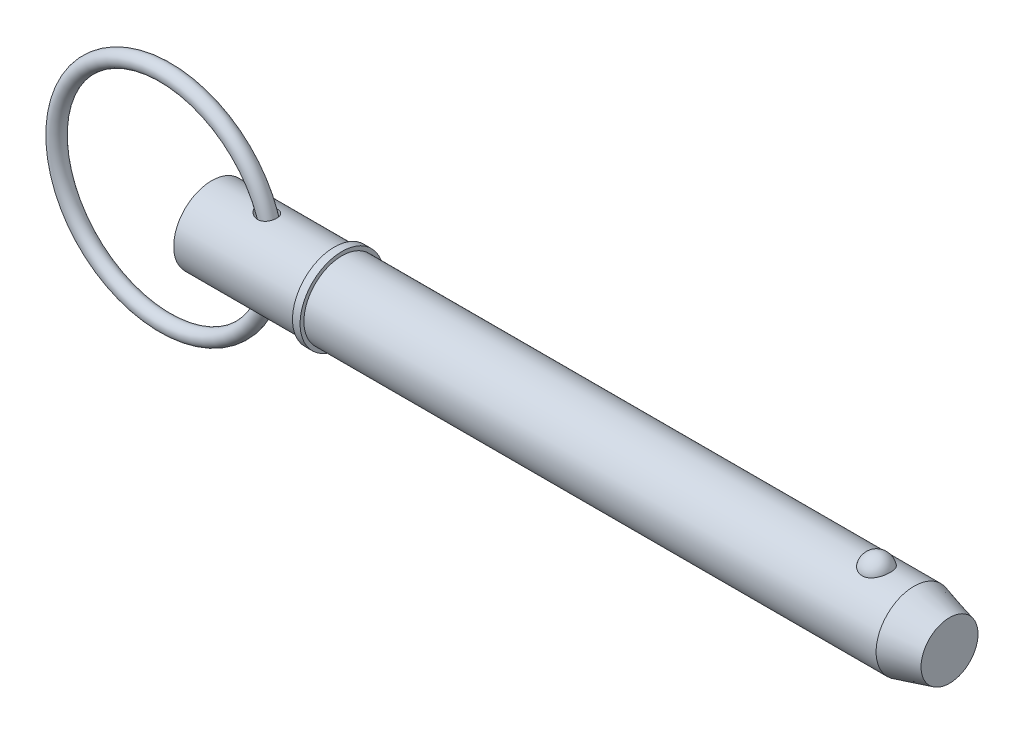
ISO-10303-21;
HEADER;
FILE_DESCRIPTION(('STEP AP214'),'2;1');
FILE_NAME('part.step','',(''),(''),'','','');
FILE_SCHEMA(('AUTOMOTIVE_DESIGN { 1 0 10303 214 1 1 1 1 }'));
ENDSEC;
DATA;
#1=APPLICATION_CONTEXT('core data for automotive mechanical design processes');
#2=APPLICATION_PROTOCOL_DEFINITION('international standard','automotive_design',2000,#1);
#3=PRODUCT_CONTEXT('',#1,'mechanical');
#4=PRODUCT('Part','Part','',(#3));
#5=PRODUCT_RELATED_PRODUCT_CATEGORY('part','',(#4));
#6=PRODUCT_DEFINITION_FORMATION('','',#4);
#7=PRODUCT_DEFINITION_CONTEXT('part definition',#1,'design');
#8=PRODUCT_DEFINITION('design','',#6,#7);
#9=PRODUCT_DEFINITION_SHAPE('','',#8);
#10=(LENGTH_UNIT() NAMED_UNIT(*) SI_UNIT(.MILLI.,.METRE.));
#11=(NAMED_UNIT(*) PLANE_ANGLE_UNIT() SI_UNIT($,.RADIAN.));
#12=(NAMED_UNIT(*) SI_UNIT($,.STERADIAN.) SOLID_ANGLE_UNIT());
#13=UNCERTAINTY_MEASURE_WITH_UNIT(LENGTH_MEASURE(1.E-05),#10,'distance_accuracy_value','');
#14=(GEOMETRIC_REPRESENTATION_CONTEXT(3) GLOBAL_UNCERTAINTY_ASSIGNED_CONTEXT((#13)) GLOBAL_UNIT_ASSIGNED_CONTEXT((#10,
#11,#12)) REPRESENTATION_CONTEXT('',''));
#15=CARTESIAN_POINT('',(0.,0.,0.));
#16=DIRECTION('',(0.,0.,1.));
#17=DIRECTION('',(1.,0.,0.));
#18=AXIS2_PLACEMENT_3D('',#15,#16,#17);
#19=CARTESIAN_POINT('',(-13.640845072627,0.,0.));
#20=DIRECTION('',(0.,0.,1.));
#21=DIRECTION('',(1.,0.,0.));
#22=AXIS2_PLACEMENT_3D('',#19,#20,#21);
#23=TOROIDAL_SURFACE('',#22,31.75,2.223);
#24=CARTESIAN_POINT('',(20.332154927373,0.,0.));
#25=VERTEX_POINT('',#24);
#26=VERTEX_LOOP('',#25);
#27=FACE_BOUND('',#26,.T.);
#28=ADVANCED_FACE('P0_F12',(#27),#23,.T.);
#29=CLOSED_SHELL('',(#28));
#30=MANIFOLD_SOLID_BREP('P0_B1',#29);
#31=CARTESIAN_POINT('',(0.,0.,0.));
#32=DIRECTION('',(1.,0.,0.));
#33=DIRECTION('',(0.,0.,-1.));
#34=AXIS2_PLACEMENT_3D('',#31,#32,#33);
#35=CYLINDRICAL_SURFACE('',#34,11.115);
#36=CARTESIAN_POINT('',(13.5245830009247,11.0328953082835,-1.34849772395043));
#37=CARTESIAN_POINT('',(13.6190616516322,11.0150940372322,-1.49413162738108));
#38=CARTESIAN_POINT('',(13.7272589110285,10.9954577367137,-1.63076546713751));
#39=CARTESIAN_POINT('',(13.9654537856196,10.9550099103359,-1.8834727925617));
#40=CARTESIAN_POINT('',(14.0954990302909,10.9341958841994,-1.99950019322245));
#41=CARTESIAN_POINT('',(14.3718600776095,10.893854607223,-2.20871939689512));
#42=CARTESIAN_POINT('',(14.5180879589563,10.8743212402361,-2.30202655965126));
#43=CARTESIAN_POINT('',(14.8233821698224,10.8385071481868,-2.46515115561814));
#44=CARTESIAN_POINT('',(14.9824448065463,10.8222254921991,-2.53497531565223));
#45=CARTESIAN_POINT('',(15.3233581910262,10.7936101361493,-2.65430007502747));
#46=CARTESIAN_POINT('',(15.5060064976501,10.7817126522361,-2.7016502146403));
#47=CARTESIAN_POINT('',(15.8771124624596,10.7657570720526,-2.76455948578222));
#48=CARTESIAN_POINT('',(16.0655695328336,10.7616981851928,-2.78012182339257));
#49=CARTESIAN_POINT('',(16.4345152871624,10.7624400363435,-2.77724928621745));
#50=CARTESIAN_POINT('',(16.6150121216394,10.7668823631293,-2.76018977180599));
#51=CARTESIAN_POINT('',(16.9695132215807,10.7837407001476,-2.69357457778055));
#52=CARTESIAN_POINT('',(17.1435222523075,10.7961507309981,-2.64404326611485));
#53=CARTESIAN_POINT('',(17.4621418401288,10.8258984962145,-2.51928348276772));
#54=CARTESIAN_POINT('',(17.6079677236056,10.8426430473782,-2.44700611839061));
#55=CARTESIAN_POINT('',(17.884162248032,10.8794194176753,-2.27791740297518));
#56=CARTESIAN_POINT('',(18.0145349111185,10.8994503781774,-2.18111245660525));
#57=CARTESIAN_POINT('',(18.2494965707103,10.9392822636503,-1.9713196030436));
#58=CARTESIAN_POINT('',(18.3550661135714,10.9590421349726,-1.85941863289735));
#59=CARTESIAN_POINT('',(18.5458147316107,10.9970986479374,-1.61919918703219));
#60=CARTESIAN_POINT('',(18.6309947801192,11.0153953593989,-1.49088149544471));
#61=CARTESIAN_POINT('',(18.7786686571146,11.0484675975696,-1.2218388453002));
#62=CARTESIAN_POINT('',(18.8412214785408,11.063252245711,-1.08114735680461));
#63=CARTESIAN_POINT('',(18.9425265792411,11.0877718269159,-0.791025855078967));
#64=CARTESIAN_POINT('',(18.9812780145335,11.0975065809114,-0.641595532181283));
#65=CARTESIAN_POINT('',(19.0343305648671,11.1109435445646,-0.336997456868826));
#66=CARTESIAN_POINT('',(19.0484404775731,11.1145985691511,-0.181794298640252));
#67=CARTESIAN_POINT('',(19.0513147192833,11.1153384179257,0.128864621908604));
#68=CARTESIAN_POINT('',(19.0400783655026,11.112423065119,0.284320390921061));
#69=CARTESIAN_POINT('',(18.9924362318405,11.1003163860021,0.591525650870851));
#70=CARTESIAN_POINT('',(18.9559600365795,11.0911075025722,0.743263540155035));
#71=CARTESIAN_POINT('',(18.858576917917,11.0673920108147,1.0382524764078));
#72=CARTESIAN_POINT('',(18.7976699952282,11.0528854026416,1.18150352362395));
#73=CARTESIAN_POINT('',(18.6529960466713,11.020201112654,1.45511394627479));
#74=CARTESIAN_POINT('',(18.5692772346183,11.0020311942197,1.58549973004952));
#75=CARTESIAN_POINT('',(18.3810003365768,10.9640237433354,1.82995492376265));
#76=CARTESIAN_POINT('',(18.2764441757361,10.9441863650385,1.94402583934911));
#77=CARTESIAN_POINT('',(18.0501398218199,10.9052267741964,2.15183128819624));
#78=CARTESIAN_POINT('',(17.9285270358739,10.8861003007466,2.24571250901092));
#79=CARTESIAN_POINT('',(17.6709592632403,10.8505244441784,2.41175942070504));
#80=CARTESIAN_POINT('',(17.5350055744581,10.8340748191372,2.48392707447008));
#81=CARTESIAN_POINT('',(17.2528390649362,10.8056099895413,2.60497667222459));
#82=CARTESIAN_POINT('',(17.1066353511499,10.7935909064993,2.65387899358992));
#83=CARTESIAN_POINT('',(16.8080326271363,10.7750969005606,2.72799859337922));
#84=CARTESIAN_POINT('',(16.6556326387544,10.7686228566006,2.75321211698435));
#85=CARTESIAN_POINT('',(16.3428877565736,10.761517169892,2.78086153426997));
#86=CARTESIAN_POINT('',(16.1824599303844,10.7611149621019,2.78240297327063));
#87=CARTESIAN_POINT('',(15.863296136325,10.766478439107,2.76156874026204));
#88=CARTESIAN_POINT('',(15.7045607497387,10.7722461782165,2.73918510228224));
#89=CARTESIAN_POINT('',(15.3787211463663,10.7898500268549,2.66904167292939));
#90=CARTESIAN_POINT('',(15.2120794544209,10.8021675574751,2.61925575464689));
#91=CARTESIAN_POINT('',(14.8886284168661,10.8315482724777,2.49496357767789));
#92=CARTESIAN_POINT('',(14.731827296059,10.8486153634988,2.42043695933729));
#93=CARTESIAN_POINT('',(14.4198762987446,10.8870804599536,2.24137362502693));
#94=CARTESIAN_POINT('',(14.2658484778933,10.9087148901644,2.13492229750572));
#95=CARTESIAN_POINT('',(13.9788214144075,10.9526299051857,1.89676517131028));
#96=CARTESIAN_POINT('',(13.8458041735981,10.9749099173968,1.76508120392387));
#97=CARTESIAN_POINT('',(13.6310853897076,11.012885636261,1.50762337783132));
#98=CARTESIAN_POINT('',(13.5444453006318,11.0290026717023,1.38602082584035));
#99=CARTESIAN_POINT('',(13.392158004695,11.0581740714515,1.12983363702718));
#100=CARTESIAN_POINT('',(13.3264946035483,11.0712307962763,0.995259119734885));
#101=CARTESIAN_POINT('',(13.2464179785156,11.0874250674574,0.785640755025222));
#102=CARTESIAN_POINT('',(13.2227369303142,11.0922707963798,0.714166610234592));
#103=CARTESIAN_POINT('',(13.1820656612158,11.1006486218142,0.569277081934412));
#104=CARTESIAN_POINT('',(13.1650721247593,11.1041813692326,0.495862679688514));
#105=CARTESIAN_POINT('',(13.1381118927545,11.1098070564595,0.347711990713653));
#106=CARTESIAN_POINT('',(13.1281436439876,11.1119003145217,0.272975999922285));
#107=CARTESIAN_POINT('',(13.1154243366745,11.1145746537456,0.122890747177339));
#108=CARTESIAN_POINT('',(13.1126723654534,11.1151559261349,0.0475415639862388));
#109=CARTESIAN_POINT('',(13.115160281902,11.1146296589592,-0.160384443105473));
#110=CARTESIAN_POINT('',(13.128061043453,11.111903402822,-0.292944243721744));
#111=CARTESIAN_POINT('',(13.175691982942,11.1019662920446,-0.553751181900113));
#112=CARTESIAN_POINT('',(13.2104121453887,11.094757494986,-0.682000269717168));
#113=CARTESIAN_POINT('',(13.2891255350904,11.0787645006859,-0.901873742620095));
#114=CARTESIAN_POINT('',(13.3290466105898,11.0707438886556,-0.995044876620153));
#115=CARTESIAN_POINT('',(13.4192915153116,11.0529876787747,-1.17599209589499));
#116=CARTESIAN_POINT('',(13.4696154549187,11.0432520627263,-1.26376812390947));
#117=CARTESIAN_POINT('',(13.5245830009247,11.0328953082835,-1.34849772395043));
#118=B_SPLINE_CURVE_WITH_KNOTS('',3,(#36,#37,#38,#39,#40,#41,#42,#43,#44,#45,#46,#47,#48,#49,
#50,#51,#52,#53,#54,#55,#56,#57,#58,#59,#60,#61,#62,#63,#64,#65,#66,#67,#68,#69,#70,#71,#72,#73,
#74,#75,#76,#77,#78,#79,#80,#81,#82,#83,#84,#85,#86,#87,#88,#89,#90,#91,#92,#93,#94,#95,#96,#97,
#98,#99,#100,#101,#102,#103,#104,#105,#106,#107,#108,#109,#110,#111,#112,#113,#114,#115,#116,
#117),.UNSPECIFIED.,.T.,.F.,(4,2,2,2,2,2,2,2,2,2,2,2,2,2,2,2,2,2,2,2,2,2,2,2,2,2,2,2,2,2,2,2,2,
2,2,2,2,2,2,2,4),(0.,0.52309976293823,1.04735506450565,1.56889024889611,2.09027590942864,
2.65465173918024,3.21897064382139,3.76002078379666,4.30066536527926,4.78898318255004,
5.27717362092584,5.74028268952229,6.20336964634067,6.665240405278,7.12712754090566,
7.59258295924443,8.05805091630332,8.52482272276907,8.99159451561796,9.45738731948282,
9.9231371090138,10.3853792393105,10.8475795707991,11.3093743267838,11.7712422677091,
12.2505208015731,12.7299589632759,13.2508366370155,13.7721440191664,14.334890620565,
14.8971525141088,15.3459336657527,15.7943675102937,16.0204422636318,16.2464047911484,
16.4723173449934,16.6982013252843,17.095711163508,17.4930386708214,17.7973741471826,
18.1017128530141),.UNSPECIFIED.);
#119=CARTESIAN_POINT('',(13.5245830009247,11.0328953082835,-1.34849772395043));
#120=VERTEX_POINT('',#119);
#121=EDGE_CURVE('P1_E42',#120,#120,#118,.T.);
#122=ORIENTED_EDGE('',*,*,#121,.T.);
#123=EDGE_LOOP('',(#122));
#124=FACE_BOUND('',#123,.T.);
#125=CARTESIAN_POINT('',(0.,0.,0.));
#126=DIRECTION('',(1.,0.,0.));
#127=DIRECTION('',(0.,0.,-1.));
#128=AXIS2_PLACEMENT_3D('',#125,#126,#127);
#129=CIRCLE('',#128,11.115);
#130=CARTESIAN_POINT('',(0.,0.,-11.115));
#131=VERTEX_POINT('',#130);
#132=EDGE_CURVE('P1_E9',#131,#131,#129,.T.);
#133=ORIENTED_EDGE('',*,*,#132,.T.);
#134=EDGE_LOOP('',(#133));
#135=FACE_BOUND('',#134,.T.);
#136=CARTESIAN_POINT('',(35.877,0.,0.));
#137=DIRECTION('',(1.,0.,0.));
#138=DIRECTION('',(0.,0.,-1.));
#139=AXIS2_PLACEMENT_3D('',#136,#137,#138);
#140=CIRCLE('',#139,11.115);
#141=CARTESIAN_POINT('',(35.877,0.,-11.115));
#142=VERTEX_POINT('',#141);
#143=EDGE_CURVE('P1_E25',#142,#142,#140,.T.);
#144=ORIENTED_EDGE('',*,*,#143,.F.);
#145=EDGE_LOOP('',(#144));
#146=FACE_BOUND('',#145,.T.);
#147=CARTESIAN_POINT('',(13.5245830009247,-11.0328953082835,-1.34849772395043));
#148=CARTESIAN_POINT('',(13.449887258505,-11.0469690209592,-1.233356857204));
#149=CARTESIAN_POINT('',(13.3837464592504,-11.0598986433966,-1.11255897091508));
#150=CARTESIAN_POINT('',(13.271526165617,-11.0822620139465,-0.861680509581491));
#151=CARTESIAN_POINT('',(13.2254273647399,-11.0916991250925,-0.731609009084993));
#152=CARTESIAN_POINT('',(13.1557497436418,-11.1060943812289,-0.464578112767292));
#153=CARTESIAN_POINT('',(13.1322820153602,-11.111030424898,-0.327588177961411));
#154=CARTESIAN_POINT('',(13.1098958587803,-11.1157368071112,-0.0515139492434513));
#155=CARTESIAN_POINT('',(13.1109730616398,-11.1155080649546,0.0875699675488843));
#156=CARTESIAN_POINT('',(13.1367722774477,-11.110088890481,0.354927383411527));
#157=CARTESIAN_POINT('',(13.160070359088,-11.1051972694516,0.483348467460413));
#158=CARTESIAN_POINT('',(13.2268311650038,-11.091413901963,0.734581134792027));
#159=CARTESIAN_POINT('',(13.2702981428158,-11.0825213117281,0.857391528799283));
#160=CARTESIAN_POINT('',(13.3769008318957,-11.0612491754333,1.09871322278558));
#161=CARTESIAN_POINT('',(13.4406446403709,-11.048763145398,1.21694419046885));
#162=CARTESIAN_POINT('',(13.5844860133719,-11.0215642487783,1.44267020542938));
#163=CARTESIAN_POINT('',(13.6645903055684,-11.0068504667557,1.55016080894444));
#164=CARTESIAN_POINT('',(13.8511803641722,-10.9741237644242,1.76795565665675));
#165=CARTESIAN_POINT('',(13.959808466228,-10.9559422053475,1.87639683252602));
#166=CARTESIAN_POINT('',(14.1916437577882,-10.9197998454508,2.07642617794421));
#167=CARTESIAN_POINT('',(14.3148607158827,-10.901839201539,2.16800294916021));
#168=CARTESIAN_POINT('',(14.5931107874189,-10.8649902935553,2.34622033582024));
#169=CARTESIAN_POINT('',(14.7501095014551,-10.8463937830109,2.42986679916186));
#170=CARTESIAN_POINT('',(15.0757118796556,-10.8136392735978,2.57171975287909));
#171=CARTESIAN_POINT('',(15.2443214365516,-10.7994835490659,2.62991321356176));
#172=CARTESIAN_POINT('',(15.599068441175,-10.7767894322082,2.72147498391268));
#173=CARTESIAN_POINT('',(15.7856559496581,-10.768622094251,2.75321798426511));
#174=CARTESIAN_POINT('',(16.1617095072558,-10.7608206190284,2.78356776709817));
#175=CARTESIAN_POINT('',(16.3511739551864,-10.7611818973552,2.78219235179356));
#176=CARTESIAN_POINT('',(16.7138126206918,-10.7705428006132,2.7457129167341));
#177=CARTESIAN_POINT('',(16.8872269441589,-10.7789612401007,2.71287798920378));
#178=CARTESIAN_POINT('',(17.2247245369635,-10.8028011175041,2.61632772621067));
#179=CARTESIAN_POINT('',(17.3888134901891,-10.8182182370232,2.55263143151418));
#180=CARTESIAN_POINT('',(17.6871641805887,-10.8524191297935,2.40281428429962));
#181=CARTESIAN_POINT('',(17.8227812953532,-10.8707652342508,2.31928155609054));
#182=CARTESIAN_POINT('',(18.0770765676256,-10.9094513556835,2.12988301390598));
#183=CARTESIAN_POINT('',(18.1957578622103,-10.9297910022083,2.0240213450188));
#184=CARTESIAN_POINT('',(18.4088055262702,-10.9693230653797,1.79719870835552));
#185=CARTESIAN_POINT('',(18.5038890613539,-10.9885305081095,1.67691225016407));
#186=CARTESIAN_POINT('',(18.6726701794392,-11.0244347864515,1.42183894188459));
#187=CARTESIAN_POINT('',(18.7463681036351,-11.0411316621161,1.28705232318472));
#188=CARTESIAN_POINT('',(18.8708297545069,-11.0702507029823,1.00634471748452));
#189=CARTESIAN_POINT('',(18.9215212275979,-11.0826593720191,0.860390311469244));
#190=CARTESIAN_POINT('',(18.9984973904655,-11.1017993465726,0.561823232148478));
#191=CARTESIAN_POINT('',(19.0247811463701,-11.1085304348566,0.409210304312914));
#192=CARTESIAN_POINT('',(19.0524622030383,-11.1156244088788,0.100537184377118));
#193=CARTESIAN_POINT('',(19.0536873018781,-11.1159432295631,-0.0555394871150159));
#194=CARTESIAN_POINT('',(19.0307837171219,-11.110065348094,-0.365700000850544));
#195=CARTESIAN_POINT('',(19.0066544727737,-11.1038685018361,-0.519783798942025));
#196=CARTESIAN_POINT('',(18.9335163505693,-11.0856111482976,-0.821817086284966));
#197=CARTESIAN_POINT('',(18.88447016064,-11.0735418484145,-0.969757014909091));
#198=CARTESIAN_POINT('',(18.7625929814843,-11.0448501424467,-1.25502066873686));
#199=CARTESIAN_POINT('',(18.6897623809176,-11.0282278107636,-1.39234456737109));
#200=CARTESIAN_POINT('',(18.522359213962,-10.9923333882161,-1.65195905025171));
#201=CARTESIAN_POINT('',(18.427863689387,-10.9730707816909,-1.77430060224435));
#202=CARTESIAN_POINT('',(18.2194216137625,-10.9340072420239,-2.00099176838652));
#203=CARTESIAN_POINT('',(18.1054772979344,-10.9142063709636,-2.10534344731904));
#204=CARTESIAN_POINT('',(17.8622613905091,-10.8764452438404,-2.2924289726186));
#205=CARTESIAN_POINT('',(17.7331196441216,-10.8584715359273,-2.3753290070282));
#206=CARTESIAN_POINT('',(17.4625069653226,-10.8261386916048,-2.51860389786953));
#207=CARTESIAN_POINT('',(17.3210365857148,-10.8117793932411,-2.57897976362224));
#208=CARTESIAN_POINT('',(17.0290309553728,-10.7880576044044,-2.67648805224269));
#209=CARTESIAN_POINT('',(16.8784484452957,-10.7787241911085,-2.71348542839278));
#210=CARTESIAN_POINT('',(16.573148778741,-10.7659618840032,-2.7636855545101));
#211=CARTESIAN_POINT('',(16.4184306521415,-10.7625343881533,-2.77688267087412));
#212=CARTESIAN_POINT('',(16.1008073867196,-10.761643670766,-2.78033419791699));
#213=CARTESIAN_POINT('',(15.9378898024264,-10.7644957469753,-2.76937572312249));
#214=CARTESIAN_POINT('',(15.6157286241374,-10.7762062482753,-2.72344300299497));
#215=CARTESIAN_POINT('',(15.4564861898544,-10.7850665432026,-2.68846128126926));
#216=CARTESIAN_POINT('',(15.1305734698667,-10.808737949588,-2.59174021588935));
#217=CARTESIAN_POINT('',(14.9645834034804,-10.8240246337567,-2.52782071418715));
#218=CARTESIAN_POINT('',(14.6448218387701,-10.8585969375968,-2.37491543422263));
#219=CARTESIAN_POINT('',(14.4910653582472,-10.8778873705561,-2.28589943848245));
#220=CARTESIAN_POINT('',(14.1837929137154,-10.920550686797,-2.07312951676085));
#221=CARTESIAN_POINT('',(14.0321999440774,-10.9441390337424,-1.94661563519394));
#222=CARTESIAN_POINT('',(13.756115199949,-10.9902311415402,-1.66673537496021));
#223=CARTESIAN_POINT('',(13.6315733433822,-11.0127368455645,-1.51341958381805));
#224=CARTESIAN_POINT('',(13.5245830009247,-11.0328953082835,-1.34849772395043));
#225=B_SPLINE_CURVE_WITH_KNOTS('',3,(#147,#148,#149,#150,#151,#152,#153,#154,#155,#156,#157,
#158,#159,#160,#161,#162,#163,#164,#165,#166,#167,#168,#169,#170,#171,#172,#173,#174,#175,#176,
#177,#178,#179,#180,#181,#182,#183,#184,#185,#186,#187,#188,#189,#190,#191,#192,#193,#194,#195,
#196,#197,#198,#199,#200,#201,#202,#203,#204,#205,#206,#207,#208,#209,#210,#211,#212,#213,#214,
#215,#216,#217,#218,#219,#220,#221,#222,#223,#224),.UNSPECIFIED.,.T.,.F.,(4,2,2,2,2,2,2,2,2,2,2,
2,2,2,2,2,2,2,2,2,2,2,2,2,2,2,2,2,2,2,2,2,2,2,2,2,2,2,4),(0.,0.4133945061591,0.8263899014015,
1.24140245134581,1.65634113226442,2.04635967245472,2.43646050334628,2.83958259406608,
3.24287078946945,3.70479277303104,4.16702582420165,4.70130512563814,5.23585761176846,
5.80123945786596,6.36631739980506,6.89348344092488,7.42032464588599,7.8989135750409,
8.37741373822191,8.83881993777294,9.30021877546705,9.76305681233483,10.2259125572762,
10.6919479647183,11.1579936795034,11.6247393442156,12.0914773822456,12.55658073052,
13.0216306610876,13.4829619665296,13.9442725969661,14.408224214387,14.8722856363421,
15.3601762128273,15.8482186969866,16.3815107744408,16.9154477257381,17.5086806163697,
18.1008056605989),.UNSPECIFIED.);
#226=CARTESIAN_POINT('',(13.5245830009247,-11.0328953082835,-1.34849772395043));
#227=VERTEX_POINT('',#226);
#228=EDGE_CURVE('P1_E17',#227,#227,#225,.T.);
#229=ORIENTED_EDGE('',*,*,#228,.T.);
#230=EDGE_LOOP('',(#229));
#231=FACE_BOUND('',#230,.T.);
#232=ADVANCED_FACE('P1_F13',(#124,#135,#146,#231),#35,.T.);
#233=CARTESIAN_POINT('',(0.,0.,0.));
#234=DIRECTION('',(1.,0.,0.));
#235=DIRECTION('',(0.,0.,-1.));
#236=AXIS2_PLACEMENT_3D('',#233,#234,#235);
#237=CYLINDRICAL_SURFACE('',#236,11.115);
#238=CARTESIAN_POINT('',(205.529563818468,0.,0.));
#239=DIRECTION('',(1.,0.,0.));
#240=DIRECTION('',(0.,0.,-1.));
#241=AXIS2_PLACEMENT_3D('',#238,#239,#240);
#242=CIRCLE('',#241,11.115);
#243=CARTESIAN_POINT('',(205.529563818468,0.,-11.115));
#244=VERTEX_POINT('',#243);
#245=EDGE_CURVE('P1_E99',#244,#244,#242,.T.);
#246=ORIENTED_EDGE('',*,*,#245,.F.);
#247=EDGE_LOOP('',(#246));
#248=FACE_BOUND('',#247,.T.);
#249=CARTESIAN_POINT('',(38.1,0.,0.));
#250=DIRECTION('',(1.,0.,0.));
#251=DIRECTION('',(0.,0.,-1.));
#252=AXIS2_PLACEMENT_3D('',#249,#250,#251);
#253=CIRCLE('',#252,11.115);
#254=CARTESIAN_POINT('',(38.1,0.,-11.115));
#255=VERTEX_POINT('',#254);
#256=EDGE_CURVE('P1_E96',#255,#255,#253,.T.);
#257=ORIENTED_EDGE('',*,*,#256,.T.);
#258=EDGE_LOOP('',(#257));
#259=FACE_BOUND('',#258,.T.);
#260=CARTESIAN_POINT('',(194.531068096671,10.3028087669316,4.17077409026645));
#261=CARTESIAN_POINT('',(194.314775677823,10.3028003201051,4.17078240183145));
#262=CARTESIAN_POINT('',(194.098548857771,10.3098895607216,4.15340593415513));
#263=CARTESIAN_POINT('',(193.672540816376,10.3373834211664,4.08449540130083));
#264=CARTESIAN_POINT('',(193.462757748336,10.3577841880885,4.0329712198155));
#265=CARTESIAN_POINT('',(193.055782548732,10.4095237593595,3.89746513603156));
#266=CARTESIAN_POINT('',(192.858572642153,10.4408466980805,3.81353029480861));
#267=CARTESIAN_POINT('',(192.481338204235,10.5110236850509,3.61560339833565));
#268=CARTESIAN_POINT('',(192.301317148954,10.5498792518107,3.50160528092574));
#269=CARTESIAN_POINT('',(191.957684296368,10.6322884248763,3.24292464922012));
#270=CARTESIAN_POINT('',(191.794686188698,10.6759443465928,3.0974604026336));
#271=CARTESIAN_POINT('',(191.494591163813,10.7625291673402,2.78171925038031));
#272=CARTESIAN_POINT('',(191.357499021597,10.8054579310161,2.61143778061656));
#273=CARTESIAN_POINT('',(191.106408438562,10.8881935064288,2.24226695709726));
#274=CARTESIAN_POINT('',(190.993710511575,10.9277761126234,2.04244123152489));
#275=CARTESIAN_POINT('',(190.801777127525,10.997484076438,1.62578254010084));
#276=CARTESIAN_POINT('',(190.722544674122,11.0276085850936,1.40894804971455));
#277=CARTESIAN_POINT('',(190.598303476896,11.0756732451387,0.961250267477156));
#278=CARTESIAN_POINT('',(190.553760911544,11.0934470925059,0.730239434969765));
#279=CARTESIAN_POINT('',(190.501569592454,11.1143331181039,0.263439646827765));
#280=CARTESIAN_POINT('',(190.493920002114,11.1174456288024,0.0276507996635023));
#281=CARTESIAN_POINT('',(190.51561056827,11.1087161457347,-0.440729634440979));
#282=CARTESIAN_POINT('',(190.544762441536,11.0969502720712,-0.673331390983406));
#283=CARTESIAN_POINT('',(190.639143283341,11.0597872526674,-1.12996621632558));
#284=CARTESIAN_POINT('',(190.704372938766,11.0343898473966,-1.35399912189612));
#285=CARTESIAN_POINT('',(190.86969844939,10.972515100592,-1.78750286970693));
#286=CARTESIAN_POINT('',(190.96983863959,10.9360236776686,-1.9969547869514));
#287=CARTESIAN_POINT('',(191.202940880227,10.8557595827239,-2.3952066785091));
#288=CARTESIAN_POINT('',(191.335905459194,10.8119863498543,-2.5840050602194));
#289=CARTESIAN_POINT('',(191.632407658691,10.7216733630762,-2.93635726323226));
#290=CARTESIAN_POINT('',(191.796056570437,10.675123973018,-3.09981510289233));
#291=CARTESIAN_POINT('',(192.149860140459,10.5846571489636,-3.39592247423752));
#292=CARTESIAN_POINT('',(192.340012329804,10.5407394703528,-3.52857487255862));
#293=CARTESIAN_POINT('',(192.73750141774,10.4616690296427,-3.75646057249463));
#294=CARTESIAN_POINT('',(192.94436705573,10.4263443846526,-3.85245432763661));
#295=CARTESIAN_POINT('',(193.372954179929,10.3675574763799,-4.00798747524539));
#296=CARTESIAN_POINT('',(193.594670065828,10.344090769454,-4.0675405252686));
#297=CARTESIAN_POINT('',(194.034669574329,10.3128282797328,-4.14614314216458));
#298=CARTESIAN_POINT('',(194.252565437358,10.3043040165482,-4.1670783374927));
#299=CARTESIAN_POINT('',(194.68894951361,10.3016771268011,-4.17357158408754));
#300=CARTESIAN_POINT('',(194.907437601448,10.3075716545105,-4.15913661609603));
#301=CARTESIAN_POINT('',(195.331744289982,10.3326686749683,-4.09636961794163));
#302=CARTESIAN_POINT('',(195.537745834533,10.3514555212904,-4.0490957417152));
#303=CARTESIAN_POINT('',(195.938576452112,10.399818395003,-3.92320197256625));
#304=CARTESIAN_POINT('',(196.1334046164,10.4293952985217,-3.84457953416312));
#305=CARTESIAN_POINT('',(196.511191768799,10.4969600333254,-3.65612410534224));
#306=CARTESIAN_POINT('',(196.693797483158,10.5351178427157,-3.54564545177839));
#307=CARTESIAN_POINT('',(197.038204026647,10.6154999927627,-3.29718036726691));
#308=CARTESIAN_POINT('',(197.200000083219,10.657725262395,-3.15918764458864));
#309=CARTESIAN_POINT('',(197.506959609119,10.744212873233,-2.85163580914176));
#310=CARTESIAN_POINT('',(197.650891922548,10.7884718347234,-2.68084605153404));
#311=CARTESIAN_POINT('',(197.909237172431,10.872374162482,-2.31721864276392));
#312=CARTESIAN_POINT('',(198.023644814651,10.9120167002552,-2.12437704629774));
#313=CARTESIAN_POINT('',(198.223873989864,10.9838919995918,-1.71516999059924));
#314=CARTESIAN_POINT('',(198.30866178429,11.0158465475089,-1.49824866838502));
#315=CARTESIAN_POINT('',(198.44268382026,11.0673523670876,-1.05228572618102));
#316=CARTESIAN_POINT('',(198.491917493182,11.086903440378,-0.823243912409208));
#317=CARTESIAN_POINT('',(198.553891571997,11.1116323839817,-0.3590874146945));
#318=CARTESIAN_POINT('',(198.566566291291,11.1167843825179,-0.123962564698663));
#319=CARTESIAN_POINT('',(198.554973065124,11.1121144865,0.345220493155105));
#320=CARTESIAN_POINT('',(198.530705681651,11.1022928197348,0.57927871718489));
#321=CARTESIAN_POINT('',(198.445907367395,11.0687504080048,1.03866534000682));
#322=CARTESIAN_POINT('',(198.385529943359,11.0450885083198,1.26402641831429));
#323=CARTESIAN_POINT('',(198.229853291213,10.9863185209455,1.70076772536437));
#324=CARTESIAN_POINT('',(198.134551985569,10.9512097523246,1.91214712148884));
#325=CARTESIAN_POINT('',(197.910397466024,10.8729733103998,2.316083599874));
#326=CARTESIAN_POINT('',(197.781380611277,10.8298068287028,2.50854240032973));
#327=CARTESIAN_POINT('',(197.492732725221,10.7401896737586,2.86808766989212));
#328=CARTESIAN_POINT('',(197.333102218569,10.6937390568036,3.03517457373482));
#329=CARTESIAN_POINT('',(196.987534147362,10.6029321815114,3.33857581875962));
#330=CARTESIAN_POINT('',(196.801708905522,10.5585680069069,3.47501541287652));
#331=CARTESIAN_POINT('',(196.407875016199,10.4769321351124,3.71390897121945));
#332=CARTESIAN_POINT('',(196.199863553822,10.439661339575,3.81635861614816));
#333=CARTESIAN_POINT('',(195.754066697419,10.3749407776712,3.98910631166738));
#334=CARTESIAN_POINT('',(195.515234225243,10.3482457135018,4.05700929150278));
#335=CARTESIAN_POINT('',(195.027925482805,10.312188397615,4.14782844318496));
#336=CARTESIAN_POINT('',(194.779453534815,10.3028184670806,4.17076454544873));
#337=CARTESIAN_POINT('',(194.531068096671,10.3028087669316,4.17077409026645));
#338=B_SPLINE_CURVE_WITH_KNOTS('',3,(#260,#261,#262,#263,#264,#265,#266,#267,#268,#269,#270,
#271,#272,#273,#274,#275,#276,#277,#278,#279,#280,#281,#282,#283,#284,#285,#286,#287,#288,#289,
#290,#291,#292,#293,#294,#295,#296,#297,#298,#299,#300,#301,#302,#303,#304,#305,#306,#307,#308,
#309,#310,#311,#312,#313,#314,#315,#316,#317,#318,#319,#320,#321,#322,#323,#324,#325,#326,#327,
#328,#329,#330,#331,#332,#333,#334,#335,#336,#337),.UNSPECIFIED.,.T.,.F.,(4,2,2,2,2,2,2,2,2,2,2,
2,2,2,2,2,2,2,2,2,2,2,2,2,2,2,2,2,2,2,2,2,2,2,2,2,2,2,4),(0.,0.64796614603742,1.29574482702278,
1.94258643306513,2.58955857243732,3.25496465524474,3.92049326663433,4.61566368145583,
5.31089647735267,6.01531821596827,6.71972398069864,7.42054043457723,8.12137023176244,
8.82309331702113,9.52487047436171,10.2292439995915,10.9335519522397,11.6223330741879,
12.3108558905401,12.9647664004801,13.6185478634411,14.252184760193,14.8858731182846,
15.5334360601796,16.1811472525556,16.8611459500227,17.5412664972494,18.2431855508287,
18.9451158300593,19.6483065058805,20.3514864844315,21.0516982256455,21.7519516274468,
22.4556690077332,23.1593743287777,23.8601491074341,24.5610129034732,25.3054529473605,
26.049562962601),.UNSPECIFIED.);
#339=CARTESIAN_POINT('',(194.531068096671,10.3028087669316,4.17077409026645));
#340=VERTEX_POINT('',#339);
#341=EDGE_CURVE('P1_E34',#340,#340,#338,.T.);
#342=ORIENTED_EDGE('',*,*,#341,.T.);
#343=EDGE_LOOP('',(#342));
#344=FACE_BOUND('',#343,.T.);
#345=ADVANCED_FACE('P1_F46',(#248,#259,#344),#237,.T.);
#346=CARTESIAN_POINT('',(0.,0.,0.));
#347=DIRECTION('',(-1.,0.,0.));
#348=DIRECTION('',(0.,0.,1.));
#349=AXIS2_PLACEMENT_3D('',#346,#347,#348);
#350=PLANE('',#349);
#351=ORIENTED_EDGE('',*,*,#132,.F.);
#352=EDGE_LOOP('',(#351));
#353=FACE_BOUND('',#352,.T.);
#354=ADVANCED_FACE('P1_F15',(#353),#350,.T.);
#355=CARTESIAN_POINT('',(35.877,11.115,0.));
#356=DIRECTION('',(-1.,0.,0.));
#357=DIRECTION('',(0.,0.,1.));
#358=AXIS2_PLACEMENT_3D('',#355,#356,#357);
#359=PLANE('',#358);
#360=ORIENTED_EDGE('',*,*,#143,.T.);
#361=EDGE_LOOP('',(#360));
#362=FACE_BOUND('',#361,.T.);
#363=CARTESIAN_POINT('',(35.877,0.,0.));
#364=DIRECTION('',(1.,0.,0.));
#365=DIRECTION('',(0.,0.,-1.));
#366=AXIS2_PLACEMENT_3D('',#363,#364,#365);
#367=CIRCLE('',#366,12.2265);
#368=CARTESIAN_POINT('',(35.877,0.,-12.2265));
#369=VERTEX_POINT('',#368);
#370=EDGE_CURVE('P1_E30',#369,#369,#367,.T.);
#371=ORIENTED_EDGE('',*,*,#370,.F.);
#372=EDGE_LOOP('',(#371));
#373=FACE_BOUND('',#372,.T.);
#374=ADVANCED_FACE('P1_F81',(#362,#373),#359,.T.);
#375=CARTESIAN_POINT('',(0.,0.,0.));
#376=DIRECTION('',(1.,0.,0.));
#377=DIRECTION('',(0.,0.,-1.));
#378=AXIS2_PLACEMENT_3D('',#375,#376,#377);
#379=CYLINDRICAL_SURFACE('',#378,12.2265);
#380=ORIENTED_EDGE('',*,*,#370,.T.);
#381=EDGE_LOOP('',(#380));
#382=FACE_BOUND('',#381,.T.);
#383=CARTESIAN_POINT('',(38.1,0.,0.));
#384=DIRECTION('',(1.,0.,0.));
#385=DIRECTION('',(0.,0.,-1.));
#386=AXIS2_PLACEMENT_3D('',#383,#384,#385);
#387=CIRCLE('',#386,12.2265);
#388=CARTESIAN_POINT('',(38.1,0.,-12.2265));
#389=VERTEX_POINT('',#388);
#390=EDGE_CURVE('P1_E95',#389,#389,#387,.T.);
#391=ORIENTED_EDGE('',*,*,#390,.F.);
#392=EDGE_LOOP('',(#391));
#393=FACE_BOUND('',#392,.T.);
#394=ADVANCED_FACE('P1_F68',(#382,#393),#379,.T.);
#395=CARTESIAN_POINT('',(38.1,12.2265,0.));
#396=DIRECTION('',(1.,0.,0.));
#397=DIRECTION('',(0.,0.,-1.));
#398=AXIS2_PLACEMENT_3D('',#395,#396,#397);
#399=PLANE('',#398);
#400=ORIENTED_EDGE('',*,*,#390,.T.);
#401=EDGE_LOOP('',(#400));
#402=FACE_BOUND('',#401,.T.);
#403=ORIENTED_EDGE('',*,*,#256,.F.);
#404=EDGE_LOOP('',(#403));
#405=FACE_BOUND('',#404,.T.);
#406=ADVANCED_FACE('P1_F62',(#402,#405),#399,.T.);
#407=CARTESIAN_POINT('',(215.9,0.,0.));
#408=DIRECTION('',(-1.,0.,0.));
#409=DIRECTION('',(0.,0.,1.));
#410=AXIS2_PLACEMENT_3D('',#407,#408,#409);
#411=CONICAL_SURFACE('',#410,8.33625000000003,0.26179938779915);
#412=ORIENTED_EDGE('',*,*,#245,.T.);
#413=EDGE_LOOP('',(#412));
#414=FACE_BOUND('',#413,.T.);
#415=CARTESIAN_POINT('',(215.9,0.,0.));
#416=DIRECTION('',(1.,0.,0.));
#417=DIRECTION('',(0.,0.,-1.));
#418=AXIS2_PLACEMENT_3D('',#415,#416,#417);
#419=CIRCLE('',#418,8.33625000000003);
#420=CARTESIAN_POINT('',(215.9,0.,-8.33625000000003));
#421=VERTEX_POINT('',#420);
#422=EDGE_CURVE('P1_E41',#421,#421,#419,.T.);
#423=ORIENTED_EDGE('',*,*,#422,.F.);
#424=EDGE_LOOP('',(#423));
#425=FACE_BOUND('',#424,.T.);
#426=ADVANCED_FACE('P1_F59',(#414,#425),#411,.T.);
#427=CARTESIAN_POINT('',(215.9,8.33625000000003,0.));
#428=DIRECTION('',(1.,0.,0.));
#429=DIRECTION('',(0.,0.,-1.));
#430=AXIS2_PLACEMENT_3D('',#427,#428,#429);
#431=PLANE('',#430);
#432=ORIENTED_EDGE('',*,*,#422,.T.);
#433=EDGE_LOOP('',(#432));
#434=FACE_BOUND('',#433,.T.);
#435=ADVANCED_FACE('P1_F55',(#434),#431,.T.);
#436=CARTESIAN_POINT('',(194.531068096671,10.0035,0.));
#437=DIRECTION('',(-1.,0.,0.));
#438=DIRECTION('',(0.,1.,0.));
#439=AXIS2_PLACEMENT_3D('',#436,#437,#438);
#440=SPHERICAL_SURFACE('',#439,4.18150000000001);
#441=ORIENTED_EDGE('',*,*,#341,.F.);
#442=EDGE_LOOP('',(#441));
#443=FACE_BOUND('',#442,.T.);
#444=ADVANCED_FACE('P1_F50',(#443),#440,.T.);
#445=CARTESIAN_POINT('',(-13.640845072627,0.,0.));
#446=DIRECTION('',(0.,0.,1.));
#447=DIRECTION('',(1.,0.,0.));
#448=AXIS2_PLACEMENT_3D('',#445,#446,#447);
#449=TOROIDAL_SURFACE('',#448,31.75,2.77875);
#450=ORIENTED_EDGE('',*,*,#228,.F.);
#451=EDGE_LOOP('',(#450));
#452=FACE_BOUND('',#451,.T.);
#453=ORIENTED_EDGE('',*,*,#121,.F.);
#454=EDGE_LOOP('',(#453));
#455=FACE_BOUND('',#454,.T.);
#456=ADVANCED_FACE('P1_F54',(#452,#455),#449,.F.);
#457=CLOSED_SHELL('',(#232,#345,#354,#374,#394,#406,#426,#435,#444,#456));
#458=MANIFOLD_SOLID_BREP('P1_B1',#457);
#459=ADVANCED_BREP_SHAPE_REPRESENTATION('',(#18,#30,#458),#14);
#460=SHAPE_DEFINITION_REPRESENTATION(#9,#459);
ENDSEC;
END-ISO-10303-21;
